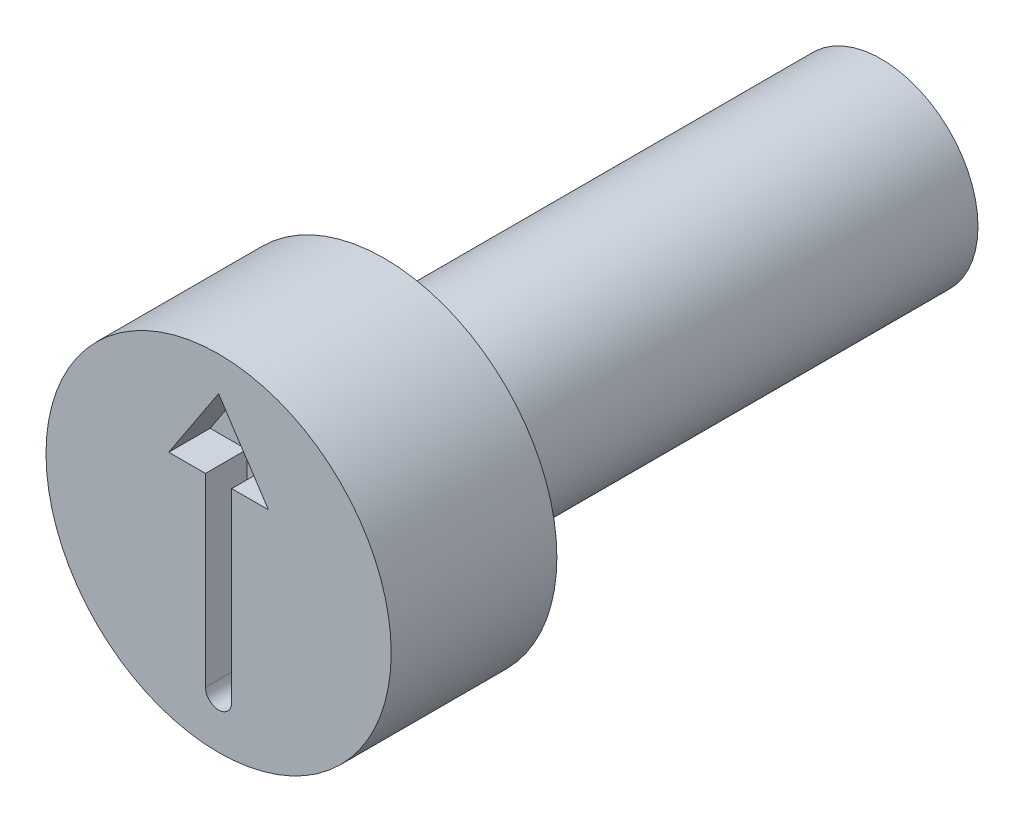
ISO-10303-21;
HEADER;
FILE_DESCRIPTION(('STEP AP214'),'2;1');
FILE_NAME('part.step','',(''),(''),'','','');
FILE_SCHEMA(('AUTOMOTIVE_DESIGN { 1 0 10303 214 1 1 1 1 }'));
ENDSEC;
DATA;
#1=APPLICATION_CONTEXT('core data for automotive mechanical design processes');
#2=APPLICATION_PROTOCOL_DEFINITION('international standard','automotive_design',2000,#1);
#3=PRODUCT_CONTEXT('',#1,'mechanical');
#4=PRODUCT('Part','Part','',(#3));
#5=PRODUCT_RELATED_PRODUCT_CATEGORY('part','',(#4));
#6=PRODUCT_DEFINITION_FORMATION('','',#4);
#7=PRODUCT_DEFINITION_CONTEXT('part definition',#1,'design');
#8=PRODUCT_DEFINITION('design','',#6,#7);
#9=PRODUCT_DEFINITION_SHAPE('','',#8);
#10=(LENGTH_UNIT() NAMED_UNIT(*) SI_UNIT(.MILLI.,.METRE.));
#11=(NAMED_UNIT(*) PLANE_ANGLE_UNIT() SI_UNIT($,.RADIAN.));
#12=(NAMED_UNIT(*) SI_UNIT($,.STERADIAN.) SOLID_ANGLE_UNIT());
#13=UNCERTAINTY_MEASURE_WITH_UNIT(LENGTH_MEASURE(1.E-05),#10,'distance_accuracy_value','');
#14=(GEOMETRIC_REPRESENTATION_CONTEXT(3) GLOBAL_UNCERTAINTY_ASSIGNED_CONTEXT((#13)) GLOBAL_UNIT_ASSIGNED_CONTEXT((#10,
#11,#12)) REPRESENTATION_CONTEXT('',''));
#15=CARTESIAN_POINT('',(0.,0.,0.));
#16=DIRECTION('',(0.,0.,1.));
#17=DIRECTION('',(1.,0.,0.));
#18=AXIS2_PLACEMENT_3D('',#15,#16,#17);
#19=CARTESIAN_POINT('',(0.,0.699999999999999,-1.2));
#20=DIRECTION('',(0.,0.,1.));
#21=DIRECTION('',(1.,0.,0.));
#22=AXIS2_PLACEMENT_3D('',#19,#20,#21);
#23=PLANE('',#22);
#24=CARTESIAN_POINT('',(0.,0.,-1.2));
#25=DIRECTION('',(0.,0.,1.));
#26=DIRECTION('',(1.,0.,0.));
#27=AXIS2_PLACEMENT_3D('',#24,#25,#26);
#28=CIRCLE('',#27,1.25);
#29=CARTESIAN_POINT('',(1.25,0.,-1.2));
#30=VERTEX_POINT('',#29);
#31=EDGE_CURVE('E11',#30,#30,#28,.T.);
#32=ORIENTED_EDGE('',*,*,#31,.F.);
#33=EDGE_LOOP('',(#32));
#34=FACE_BOUND('',#33,.T.);
#35=CARTESIAN_POINT('',(0.,0.,-1.2));
#36=DIRECTION('',(0.,0.,1.));
#37=DIRECTION('',(1.,0.,0.));
#38=AXIS2_PLACEMENT_3D('',#35,#36,#37);
#39=CIRCLE('',#38,0.699999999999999);
#40=CARTESIAN_POINT('',(0.699999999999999,0.,-1.2));
#41=VERTEX_POINT('',#40);
#42=EDGE_CURVE('E144',#41,#41,#39,.T.);
#43=ORIENTED_EDGE('',*,*,#42,.T.);
#44=EDGE_LOOP('',(#43));
#45=FACE_BOUND('',#44,.T.);
#46=ADVANCED_FACE('F34',(#34,#45),#23,.F.);
#47=CARTESIAN_POINT('',(0.,0.,-0.403888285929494));
#48=DIRECTION('',(0.,0.,1.));
#49=DIRECTION('',(1.,0.,0.));
#50=AXIS2_PLACEMENT_3D('',#47,#48,#49);
#51=CYLINDRICAL_SURFACE('',#50,1.25);
#52=CARTESIAN_POINT('',(0.,0.,0.));
#53=DIRECTION('',(0.,0.,1.));
#54=DIRECTION('',(1.,0.,0.));
#55=AXIS2_PLACEMENT_3D('',#52,#53,#54);
#56=CIRCLE('',#55,1.25);
#57=CARTESIAN_POINT('',(1.25,0.,0.));
#58=VERTEX_POINT('',#57);
#59=EDGE_CURVE('E41',#58,#58,#56,.T.);
#60=ORIENTED_EDGE('',*,*,#59,.F.);
#61=EDGE_LOOP('',(#60));
#62=FACE_BOUND('',#61,.T.);
#63=ORIENTED_EDGE('',*,*,#31,.T.);
#64=EDGE_LOOP('',(#63));
#65=FACE_BOUND('',#64,.T.);
#66=ADVANCED_FACE('F161',(#62,#65),#51,.T.);
#67=CARTESIAN_POINT('',(0.,1.25,0.));
#68=DIRECTION('',(0.,0.,-1.));
#69=DIRECTION('',(-1.,0.,0.));
#70=AXIS2_PLACEMENT_3D('',#67,#68,#69);
#71=PLANE('',#70);
#72=DIRECTION('',(0.,1.,0.));
#73=VECTOR('',#72,1.);
#74=CARTESIAN_POINT('',(0.0952365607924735,0.453175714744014,0.));
#75=LINE('',#74,#73);
#76=CARTESIAN_POINT('',(0.0952365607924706,-0.888080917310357,0.));
#77=VERTEX_POINT('',#76);
#78=CARTESIAN_POINT('',(0.0952365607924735,0.453175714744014,0.));
#79=VERTEX_POINT('',#78);
#80=EDGE_CURVE('E128',#77,#79,#75,.T.);
#81=ORIENTED_EDGE('',*,*,#80,.F.);
#82=CARTESIAN_POINT('',(0.,-0.888080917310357,0.));
#83=DIRECTION('',(0.,0.,1.));
#84=DIRECTION('',(1.,0.,0.));
#85=AXIS2_PLACEMENT_3D('',#82,#83,#84);
#86=CIRCLE('',#85,0.0952365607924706);
#87=CARTESIAN_POINT('',(-0.0952365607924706,-0.888080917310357,0.));
#88=VERTEX_POINT('',#87);
#89=EDGE_CURVE('E48',#88,#77,#86,.T.);
#90=ORIENTED_EDGE('',*,*,#89,.F.);
#91=DIRECTION('',(0.,-1.,0.));
#92=VECTOR('',#91,1.);
#93=CARTESIAN_POINT('',(-0.0952365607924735,0.453175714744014,0.));
#94=LINE('',#93,#92);
#95=CARTESIAN_POINT('',(-0.0952365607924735,0.453175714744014,0.));
#96=VERTEX_POINT('',#95);
#97=EDGE_CURVE('E140',#96,#88,#94,.T.);
#98=ORIENTED_EDGE('',*,*,#97,.F.);
#99=DIRECTION('',(1.,0.,0.));
#100=VECTOR('',#99,1.);
#101=CARTESIAN_POINT('',(-0.360958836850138,0.453175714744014,0.));
#102=LINE('',#101,#100);
#103=CARTESIAN_POINT('',(-0.360958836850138,0.453175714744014,0.));
#104=VERTEX_POINT('',#103);
#105=EDGE_CURVE('E138',#104,#96,#102,.T.);
#106=ORIENTED_EDGE('',*,*,#105,.F.);
#107=DIRECTION('',(-0.550159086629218,-0.835059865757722,0.));
#108=VECTOR('',#107,1.);
#109=CARTESIAN_POINT('',(0.,1.00105767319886,0.));
#110=LINE('',#109,#108);
#111=CARTESIAN_POINT('',(0.,1.00105767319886,0.));
#112=VERTEX_POINT('',#111);
#113=EDGE_CURVE('E102',#112,#104,#110,.T.);
#114=ORIENTED_EDGE('',*,*,#113,.F.);
#115=DIRECTION('',(-0.550159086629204,0.835059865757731,0.));
#116=VECTOR('',#115,1.);
#117=CARTESIAN_POINT('',(0.,1.00105767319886,0.));
#118=LINE('',#117,#116);
#119=CARTESIAN_POINT('',(0.360958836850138,0.453175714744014,0.));
#120=VERTEX_POINT('',#119);
#121=EDGE_CURVE('E134',#120,#112,#118,.T.);
#122=ORIENTED_EDGE('',*,*,#121,.F.);
#123=DIRECTION('',(1.,0.,0.));
#124=VECTOR('',#123,1.);
#125=CARTESIAN_POINT('',(0.360958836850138,0.453175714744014,0.));
#126=LINE('',#125,#124);
#127=EDGE_CURVE('E131',#79,#120,#126,.T.);
#128=ORIENTED_EDGE('',*,*,#127,.F.);
#129=EDGE_LOOP('',(#81,#90,#98,#106,#114,#122,#128));
#130=FACE_BOUND('',#129,.T.);
#131=ORIENTED_EDGE('',*,*,#59,.T.);
#132=EDGE_LOOP('',(#131));
#133=FACE_BOUND('',#132,.T.);
#134=ADVANCED_FACE('F159',(#130,#133),#71,.F.);
#135=CARTESIAN_POINT('',(0.,0.,-4.8));
#136=DIRECTION('',(0.,0.,1.));
#137=DIRECTION('',(1.,0.,0.));
#138=AXIS2_PLACEMENT_3D('',#135,#136,#137);
#139=PLANE('',#138);
#140=CARTESIAN_POINT('',(0.,0.,-4.8));
#141=DIRECTION('',(0.,0.,1.));
#142=DIRECTION('',(1.,0.,0.));
#143=AXIS2_PLACEMENT_3D('',#140,#141,#142);
#144=CIRCLE('',#143,0.699999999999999);
#145=CARTESIAN_POINT('',(0.699999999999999,0.,-4.8));
#146=VERTEX_POINT('',#145);
#147=EDGE_CURVE('E154',#146,#146,#144,.T.);
#148=ORIENTED_EDGE('',*,*,#147,.F.);
#149=EDGE_LOOP('',(#148));
#150=FACE_BOUND('',#149,.T.);
#151=ADVANCED_FACE('F174',(#150),#139,.F.);
#152=CARTESIAN_POINT('',(0.,0.,-0.403888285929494));
#153=DIRECTION('',(0.,0.,1.));
#154=DIRECTION('',(1.,0.,0.));
#155=AXIS2_PLACEMENT_3D('',#152,#153,#154);
#156=CYLINDRICAL_SURFACE('',#155,0.699999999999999);
#157=ORIENTED_EDGE('',*,*,#42,.F.);
#158=EDGE_LOOP('',(#157));
#159=FACE_BOUND('',#158,.T.);
#160=ORIENTED_EDGE('',*,*,#147,.T.);
#161=EDGE_LOOP('',(#160));
#162=FACE_BOUND('',#161,.T.);
#163=ADVANCED_FACE('F170',(#159,#162),#156,.T.);
#164=CARTESIAN_POINT('',(0.,-0.888080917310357,-0.3));
#165=DIRECTION('',(0.,0.,1.));
#166=DIRECTION('',(1.,0.,0.));
#167=AXIS2_PLACEMENT_3D('',#164,#165,#166);
#168=CYLINDRICAL_SURFACE('',#167,0.0952365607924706);
#169=ORIENTED_EDGE('',*,*,#89,.T.);
#170=DIRECTION('',(0.,0.,1.));
#171=VECTOR('',#170,1.);
#172=CARTESIAN_POINT('',(0.0952365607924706,-0.888080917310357,-0.3));
#173=LINE('',#172,#171);
#174=CARTESIAN_POINT('',(0.0952365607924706,-0.888080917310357,-0.3));
#175=VERTEX_POINT('',#174);
#176=EDGE_CURVE('E81',#175,#77,#173,.T.);
#177=ORIENTED_EDGE('',*,*,#176,.F.);
#178=CARTESIAN_POINT('',(0.,-0.888080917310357,-0.3));
#179=DIRECTION('',(0.,0.,1.));
#180=DIRECTION('',(1.,0.,0.));
#181=AXIS2_PLACEMENT_3D('',#178,#179,#180);
#182=CIRCLE('',#181,0.0952365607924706);
#183=CARTESIAN_POINT('',(-0.0952365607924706,-0.888080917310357,-0.3));
#184=VERTEX_POINT('',#183);
#185=EDGE_CURVE('E142',#184,#175,#182,.T.);
#186=ORIENTED_EDGE('',*,*,#185,.F.);
#187=DIRECTION('',(0.,0.,1.));
#188=VECTOR('',#187,1.);
#189=CARTESIAN_POINT('',(-0.0952365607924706,-0.888080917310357,-0.3));
#190=LINE('',#189,#188);
#191=EDGE_CURVE('E56',#184,#88,#190,.T.);
#192=ORIENTED_EDGE('',*,*,#191,.T.);
#193=EDGE_LOOP('',(#169,#177,#186,#192));
#194=FACE_BOUND('',#193,.T.);
#195=ADVANCED_FACE('F173',(#194),#168,.F.);
#196=CARTESIAN_POINT('',(-0.0952365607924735,0.453175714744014,-0.3));
#197=DIRECTION('',(-1.,0.,0.));
#198=DIRECTION('',(0.,-1.,0.));
#199=AXIS2_PLACEMENT_3D('',#196,#197,#198);
#200=PLANE('',#199);
#201=ORIENTED_EDGE('',*,*,#97,.T.);
#202=ORIENTED_EDGE('',*,*,#191,.F.);
#203=DIRECTION('',(0.,-1.,0.));
#204=VECTOR('',#203,1.);
#205=CARTESIAN_POINT('',(-0.0952365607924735,0.453175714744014,-0.3));
#206=LINE('',#205,#204);
#207=CARTESIAN_POINT('',(-0.0952365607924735,0.453175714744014,-0.3));
#208=VERTEX_POINT('',#207);
#209=EDGE_CURVE('E114',#208,#184,#206,.T.);
#210=ORIENTED_EDGE('',*,*,#209,.F.);
#211=DIRECTION('',(0.,0.,1.));
#212=VECTOR('',#211,1.);
#213=CARTESIAN_POINT('',(-0.0952365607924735,0.453175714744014,-0.3));
#214=LINE('',#213,#212);
#215=EDGE_CURVE('E106',#208,#96,#214,.T.);
#216=ORIENTED_EDGE('',*,*,#215,.T.);
#217=EDGE_LOOP('',(#201,#202,#210,#216));
#218=FACE_BOUND('',#217,.T.);
#219=ADVANCED_FACE('F188',(#218),#200,.F.);
#220=CARTESIAN_POINT('',(-0.360958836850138,0.453175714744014,-0.3));
#221=DIRECTION('',(0.,-1.,0.));
#222=DIRECTION('',(0.,0.,-1.));
#223=AXIS2_PLACEMENT_3D('',#220,#221,#222);
#224=PLANE('',#223);
#225=ORIENTED_EDGE('',*,*,#105,.T.);
#226=ORIENTED_EDGE('',*,*,#215,.F.);
#227=DIRECTION('',(1.,0.,0.));
#228=VECTOR('',#227,1.);
#229=CARTESIAN_POINT('',(-0.360958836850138,0.453175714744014,-0.3));
#230=LINE('',#229,#228);
#231=CARTESIAN_POINT('',(-0.360958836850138,0.453175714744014,-0.3));
#232=VERTEX_POINT('',#231);
#233=EDGE_CURVE('E110',#232,#208,#230,.T.);
#234=ORIENTED_EDGE('',*,*,#233,.F.);
#235=DIRECTION('',(0.,0.,1.));
#236=VECTOR('',#235,1.);
#237=CARTESIAN_POINT('',(-0.360958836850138,0.453175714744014,-0.3));
#238=LINE('',#237,#236);
#239=EDGE_CURVE('E95',#232,#104,#238,.T.);
#240=ORIENTED_EDGE('',*,*,#239,.T.);
#241=EDGE_LOOP('',(#225,#226,#234,#240));
#242=FACE_BOUND('',#241,.T.);
#243=ADVANCED_FACE('F111',(#242),#224,.F.);
#244=CARTESIAN_POINT('',(0.,1.00105767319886,-0.3));
#245=DIRECTION('',(-0.835059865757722,0.550159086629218,0.));
#246=DIRECTION('',(-0.550159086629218,-0.835059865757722,0.));
#247=AXIS2_PLACEMENT_3D('',#244,#245,#246);
#248=PLANE('',#247);
#249=ORIENTED_EDGE('',*,*,#113,.T.);
#250=ORIENTED_EDGE('',*,*,#239,.F.);
#251=DIRECTION('',(-0.550159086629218,-0.835059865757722,0.));
#252=VECTOR('',#251,1.);
#253=CARTESIAN_POINT('',(0.,1.00105767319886,-0.3));
#254=LINE('',#253,#252);
#255=CARTESIAN_POINT('',(0.,1.00105767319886,-0.3));
#256=VERTEX_POINT('',#255);
#257=EDGE_CURVE('E99',#256,#232,#254,.T.);
#258=ORIENTED_EDGE('',*,*,#257,.F.);
#259=DIRECTION('',(0.,0.,1.));
#260=VECTOR('',#259,1.);
#261=CARTESIAN_POINT('',(0.,1.00105767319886,-0.3));
#262=LINE('',#261,#260);
#263=EDGE_CURVE('E107',#256,#112,#262,.T.);
#264=ORIENTED_EDGE('',*,*,#263,.T.);
#265=EDGE_LOOP('',(#249,#250,#258,#264));
#266=FACE_BOUND('',#265,.T.);
#267=ADVANCED_FACE('F97',(#266),#248,.F.);
#268=CARTESIAN_POINT('',(0.,1.00105767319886,-0.3));
#269=DIRECTION('',(0.835059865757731,0.550159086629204,0.));
#270=DIRECTION('',(-0.550159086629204,0.835059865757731,0.));
#271=AXIS2_PLACEMENT_3D('',#268,#269,#270);
#272=PLANE('',#271);
#273=ORIENTED_EDGE('',*,*,#121,.T.);
#274=ORIENTED_EDGE('',*,*,#263,.F.);
#275=DIRECTION('',(-0.550159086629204,0.835059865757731,0.));
#276=VECTOR('',#275,1.);
#277=CARTESIAN_POINT('',(0.,1.00105767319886,-0.3));
#278=LINE('',#277,#276);
#279=CARTESIAN_POINT('',(0.360958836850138,0.453175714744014,-0.3));
#280=VERTEX_POINT('',#279);
#281=EDGE_CURVE('E120',#280,#256,#278,.T.);
#282=ORIENTED_EDGE('',*,*,#281,.F.);
#283=DIRECTION('',(0.,0.,1.));
#284=VECTOR('',#283,1.);
#285=CARTESIAN_POINT('',(0.360958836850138,0.453175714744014,-0.3));
#286=LINE('',#285,#284);
#287=EDGE_CURVE('E147',#280,#120,#286,.T.);
#288=ORIENTED_EDGE('',*,*,#287,.T.);
#289=EDGE_LOOP('',(#273,#274,#282,#288));
#290=FACE_BOUND('',#289,.T.);
#291=ADVANCED_FACE('F196',(#290),#272,.F.);
#292=CARTESIAN_POINT('',(0.360958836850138,0.453175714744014,-0.3));
#293=DIRECTION('',(0.,-1.,0.));
#294=DIRECTION('',(0.,0.,-1.));
#295=AXIS2_PLACEMENT_3D('',#292,#293,#294);
#296=PLANE('',#295);
#297=ORIENTED_EDGE('',*,*,#127,.T.);
#298=ORIENTED_EDGE('',*,*,#287,.F.);
#299=DIRECTION('',(1.,0.,0.));
#300=VECTOR('',#299,1.);
#301=CARTESIAN_POINT('',(0.360958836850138,0.453175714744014,-0.3));
#302=LINE('',#301,#300);
#303=CARTESIAN_POINT('',(0.0952365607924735,0.453175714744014,-0.3));
#304=VERTEX_POINT('',#303);
#305=EDGE_CURVE('E122',#304,#280,#302,.T.);
#306=ORIENTED_EDGE('',*,*,#305,.F.);
#307=DIRECTION('',(0.,0.,1.));
#308=VECTOR('',#307,1.);
#309=CARTESIAN_POINT('',(0.0952365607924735,0.453175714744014,-0.3));
#310=LINE('',#309,#308);
#311=EDGE_CURVE('E149',#304,#79,#310,.T.);
#312=ORIENTED_EDGE('',*,*,#311,.T.);
#313=EDGE_LOOP('',(#297,#298,#306,#312));
#314=FACE_BOUND('',#313,.T.);
#315=ADVANCED_FACE('F192',(#314),#296,.F.);
#316=CARTESIAN_POINT('',(0.0952365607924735,0.453175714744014,-0.3));
#317=DIRECTION('',(1.,0.,0.));
#318=DIRECTION('',(0.,1.,0.));
#319=AXIS2_PLACEMENT_3D('',#316,#317,#318);
#320=PLANE('',#319);
#321=ORIENTED_EDGE('',*,*,#80,.T.);
#322=ORIENTED_EDGE('',*,*,#311,.F.);
#323=DIRECTION('',(0.,1.,0.));
#324=VECTOR('',#323,1.);
#325=CARTESIAN_POINT('',(0.0952365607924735,0.453175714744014,-0.3));
#326=LINE('',#325,#324);
#327=EDGE_CURVE('E290',#175,#304,#326,.T.);
#328=ORIENTED_EDGE('',*,*,#327,.F.);
#329=ORIENTED_EDGE('',*,*,#176,.T.);
#330=EDGE_LOOP('',(#321,#322,#328,#329));
#331=FACE_BOUND('',#330,.T.);
#332=ADVANCED_FACE('F189',(#331),#320,.F.);
#333=CARTESIAN_POINT('',(0.,-0.888080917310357,-0.3));
#334=DIRECTION('',(0.,0.,1.));
#335=DIRECTION('',(1.,0.,0.));
#336=AXIS2_PLACEMENT_3D('',#333,#334,#335);
#337=PLANE('',#336);
#338=ORIENTED_EDGE('',*,*,#185,.T.);
#339=ORIENTED_EDGE('',*,*,#327,.T.);
#340=ORIENTED_EDGE('',*,*,#305,.T.);
#341=ORIENTED_EDGE('',*,*,#281,.T.);
#342=ORIENTED_EDGE('',*,*,#257,.T.);
#343=ORIENTED_EDGE('',*,*,#233,.T.);
#344=ORIENTED_EDGE('',*,*,#209,.T.);
#345=EDGE_LOOP('',(#338,#339,#340,#341,#342,#343,#344));
#346=FACE_BOUND('',#345,.T.);
#347=ADVANCED_FACE('F117',(#346),#337,.T.);
#348=CLOSED_SHELL('',(#46,#66,#134,#151,#163,#195,#219,#243,#267,#291,#315,#332,#347));
#349=MANIFOLD_SOLID_BREP('B2',#348);
#350=ADVANCED_BREP_SHAPE_REPRESENTATION('',(#18,#349),#14);
#351=SHAPE_DEFINITION_REPRESENTATION(#9,#350);
ENDSEC;
END-ISO-10303-21;
